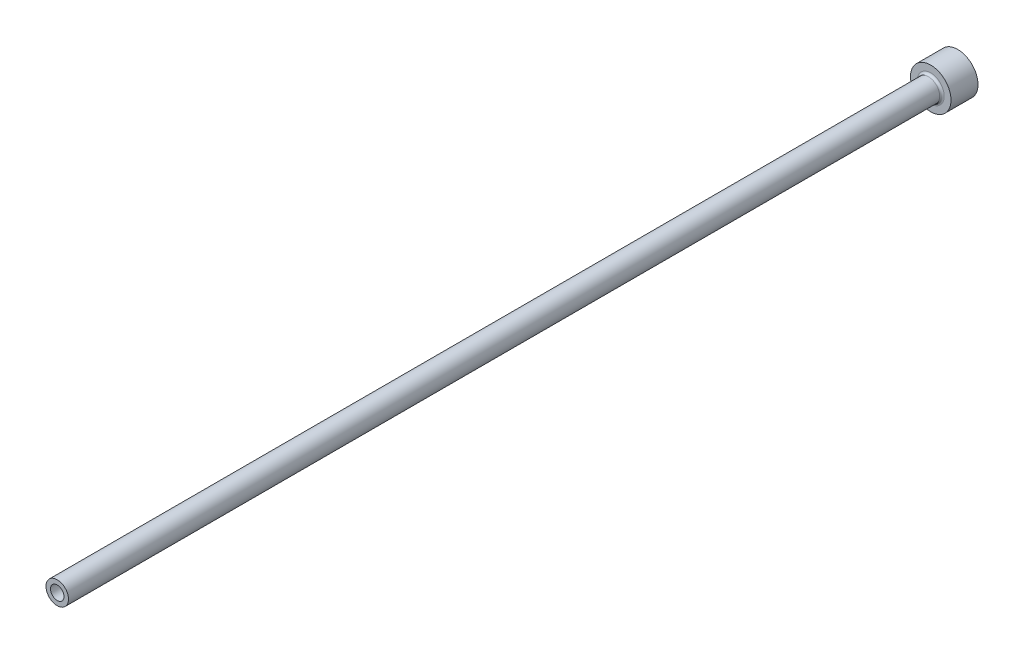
from build123d import *

# Parameters (mm, degrees)
HEAD_FILLET_R          = 0.5
ID_RELIEF_CHAMFER_SIZE = 0.5


with BuildPart() as part:
    # OD FV → Base Revolve (revolve)
    with BuildSketch(Plane(origin=(0, 0, 0), x_dir=(1, 0, 0), z_dir=(0, 1, 0))):
        Polygon((0, -200), (2.5, -200), (2.5, -6), (4.5, -6), (4.5, 0), (0, 0), align=None)
    revolve(axis=Axis((0, 0, 200), (0, 0, -1)))

    # ID FV → Hole (revolve, cut)
    with BuildSketch(Plane(origin=(0, 0, 0), x_dir=(1, 0, 0), z_dir=(0, 1, 0))):
        Polygon((0, -200), (1.5, -200), (1.5, -125), (1.75, -124.566987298), (1.75, 0), (0, 0), align=None)
    revolve(axis=Axis((0, 0, 200), (0, 0, -1)), mode=Mode.SUBTRACT)

    # Head Fillet
    head_fillet_edges = [part.edges().sort_by_distance(p)[0] for p in [
        (-2.5, 0, 6),
    ]]
    fillet(head_fillet_edges, radius=HEAD_FILLET_R)

    # ID Relief Chamfer
    id_relief_chamfer_edges = [part.edges().sort_by_distance(p)[0] for p in [
        (-1.75, 0, 0),
    ]]
    chamfer(id_relief_chamfer_edges, length=ID_RELIEF_CHAMFER_SIZE)


solid = part.part
